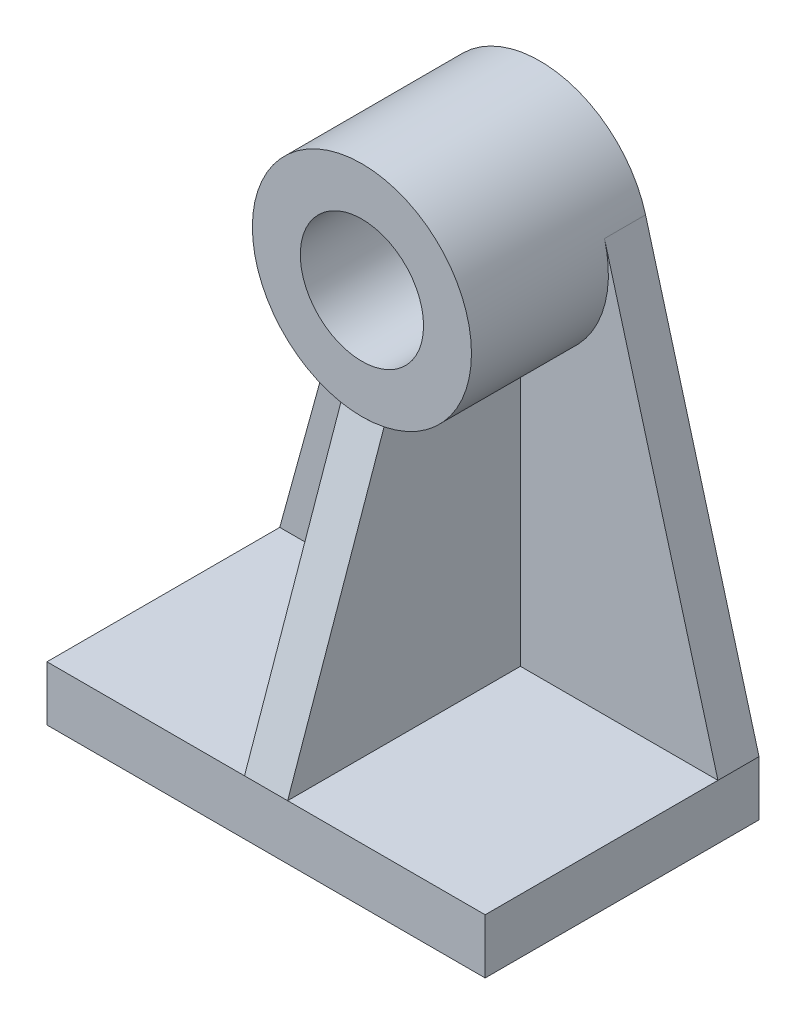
ISO-10303-21;
HEADER;
FILE_DESCRIPTION(('STEP AP214'),'2;1');
FILE_NAME('part.step','',(''),(''),'','','');
FILE_SCHEMA(('AUTOMOTIVE_DESIGN { 1 0 10303 214 1 1 1 1 }'));
ENDSEC;
DATA;
#1=APPLICATION_CONTEXT('core data for automotive mechanical design processes');
#2=APPLICATION_PROTOCOL_DEFINITION('international standard','automotive_design',2000,#1);
#3=PRODUCT_CONTEXT('',#1,'mechanical');
#4=PRODUCT('Part','Part','',(#3));
#5=PRODUCT_RELATED_PRODUCT_CATEGORY('part','',(#4));
#6=PRODUCT_DEFINITION_FORMATION('','',#4);
#7=PRODUCT_DEFINITION_CONTEXT('part definition',#1,'design');
#8=PRODUCT_DEFINITION('design','',#6,#7);
#9=PRODUCT_DEFINITION_SHAPE('','',#8);
#10=(LENGTH_UNIT() NAMED_UNIT(*) SI_UNIT(.MILLI.,.METRE.));
#11=(NAMED_UNIT(*) PLANE_ANGLE_UNIT() SI_UNIT($,.RADIAN.));
#12=(NAMED_UNIT(*) SI_UNIT($,.STERADIAN.) SOLID_ANGLE_UNIT());
#13=UNCERTAINTY_MEASURE_WITH_UNIT(LENGTH_MEASURE(1.E-05),#10,'distance_accuracy_value','');
#14=(GEOMETRIC_REPRESENTATION_CONTEXT(3) GLOBAL_UNCERTAINTY_ASSIGNED_CONTEXT((#13)) GLOBAL_UNIT_ASSIGNED_CONTEXT((#10,
#11,#12)) REPRESENTATION_CONTEXT('',''));
#15=CARTESIAN_POINT('',(0.,0.,0.));
#16=DIRECTION('',(0.,0.,1.));
#17=DIRECTION('',(1.,0.,0.));
#18=AXIS2_PLACEMENT_3D('',#15,#16,#17);
#19=CARTESIAN_POINT('',(0.,0.,9.525));
#20=DIRECTION('',(0.,0.,1.));
#21=DIRECTION('',(1.,0.,0.));
#22=AXIS2_PLACEMENT_3D('',#19,#20,#21);
#23=PLANE('',#22);
#24=DIRECTION('',(-1.,0.,0.));
#25=VECTOR('',#24,1.);
#26=CARTESIAN_POINT('',(-50.8,-88.9,9.525));
#27=LINE('',#26,#25);
#28=CARTESIAN_POINT('',(-5.,-88.9,9.525));
#29=VERTEX_POINT('',#28);
#30=CARTESIAN_POINT('',(-50.8,-88.9,9.525));
#31=VERTEX_POINT('',#30);
#32=EDGE_CURVE('E156',#29,#31,#27,.T.);
#33=ORIENTED_EDGE('',*,*,#32,.F.);
#34=DIRECTION('',(0.,1.,0.));
#35=VECTOR('',#34,1.);
#36=CARTESIAN_POINT('',(-5.,0.,9.525));
#37=LINE('',#36,#35);
#38=CARTESIAN_POINT('',(-5.,-24.9030118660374,9.525));
#39=VERTEX_POINT('',#38);
#40=EDGE_CURVE('E134',#29,#39,#37,.T.);
#41=ORIENTED_EDGE('',*,*,#40,.T.);
#42=CARTESIAN_POINT('',(0.,0.,9.525));
#43=DIRECTION('',(0.,0.,1.));
#44=DIRECTION('',(1.,0.,0.));
#45=AXIS2_PLACEMENT_3D('',#42,#43,#44);
#46=CIRCLE('',#45,25.4);
#47=CARTESIAN_POINT('',(-24.4901906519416,6.73725180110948,9.525));
#48=VERTEX_POINT('',#47);
#49=EDGE_CURVE('E36',#39,#48,#46,.F.);
#50=ORIENTED_EDGE('',*,*,#49,.T.);
#51=DIRECTION('',(-0.265246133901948,-0.964180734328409,0.));
#52=VECTOR('',#51,1.);
#53=CARTESIAN_POINT('',(-50.8,-88.9,9.525));
#54=LINE('',#53,#52);
#55=EDGE_CURVE('E190',#48,#31,#54,.T.);
#56=ORIENTED_EDGE('',*,*,#55,.T.);
#57=EDGE_LOOP('',(#33,#41,#50,#56));
#58=FACE_BOUND('',#57,.T.);
#59=ADVANCED_FACE('F28',(#58),#23,.T.);
#60=CARTESIAN_POINT('',(-50.8,-88.9,63.5));
#61=DIRECTION('',(0.,-1.,0.));
#62=DIRECTION('',(1.,0.,0.));
#63=AXIS2_PLACEMENT_3D('',#60,#61,#62);
#64=PLANE('',#63);
#65=DIRECTION('',(0.,0.,1.));
#66=VECTOR('',#65,1.);
#67=CARTESIAN_POINT('',(-5.,-88.9,63.5));
#68=LINE('',#67,#66);
#69=CARTESIAN_POINT('',(-5.,-88.9,63.5));
#70=VERTEX_POINT('',#69);
#71=EDGE_CURVE('E128',#29,#70,#68,.T.);
#72=ORIENTED_EDGE('',*,*,#71,.F.);
#73=ORIENTED_EDGE('',*,*,#32,.T.);
#74=DIRECTION('',(0.,0.,-1.));
#75=VECTOR('',#74,1.);
#76=CARTESIAN_POINT('',(-50.8,-88.9,63.5));
#77=LINE('',#76,#75);
#78=CARTESIAN_POINT('',(-50.8,-88.9,63.5));
#79=VERTEX_POINT('',#78);
#80=EDGE_CURVE('E171',#79,#31,#77,.T.);
#81=ORIENTED_EDGE('',*,*,#80,.F.);
#82=DIRECTION('',(-1.,0.,0.));
#83=VECTOR('',#82,1.);
#84=CARTESIAN_POINT('',(-50.8,-88.9,63.5));
#85=LINE('',#84,#83);
#86=EDGE_CURVE('E164',#70,#79,#85,.T.);
#87=ORIENTED_EDGE('',*,*,#86,.F.);
#88=EDGE_LOOP('',(#72,#73,#81,#87));
#89=FACE_BOUND('',#88,.T.);
#90=ADVANCED_FACE('F238',(#89),#64,.F.);
#91=DIRECTION('',(0.,1.,0.));
#92=VECTOR('',#91,1.);
#93=CARTESIAN_POINT('',(5.,0.,9.525));
#94=LINE('',#93,#92);
#95=CARTESIAN_POINT('',(5.,-88.9,9.525));
#96=VERTEX_POINT('',#95);
#97=CARTESIAN_POINT('',(5.,-24.9030118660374,9.525));
#98=VERTEX_POINT('',#97);
#99=EDGE_CURVE('E137',#96,#98,#94,.T.);
#100=ORIENTED_EDGE('',*,*,#99,.F.);
#101=CARTESIAN_POINT('',(50.8,-88.9,9.525));
#102=VERTEX_POINT('',#101);
#103=EDGE_CURVE('E157',#102,#96,#27,.T.);
#104=ORIENTED_EDGE('',*,*,#103,.F.);
#105=DIRECTION('',(-0.265246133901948,0.964180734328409,0.));
#106=VECTOR('',#105,1.);
#107=CARTESIAN_POINT('',(50.8,-88.9,9.525));
#108=LINE('',#107,#106);
#109=CARTESIAN_POINT('',(24.4901906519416,6.73725180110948,9.525));
#110=VERTEX_POINT('',#109);
#111=EDGE_CURVE('E192',#102,#110,#108,.T.);
#112=ORIENTED_EDGE('',*,*,#111,.T.);
#113=EDGE_CURVE('E11',#110,#98,#46,.F.);
#114=ORIENTED_EDGE('',*,*,#113,.T.);
#115=EDGE_LOOP('',(#100,#104,#112,#114));
#116=FACE_BOUND('',#115,.T.);
#117=ADVANCED_FACE('F242',(#116),#23,.T.);
#118=CARTESIAN_POINT('',(-50.8,-88.9,9.525));
#119=DIRECTION('',(0.964180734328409,-0.265246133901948,0.));
#120=DIRECTION('',(0.265246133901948,0.964180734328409,0.));
#121=AXIS2_PLACEMENT_3D('',#118,#119,#120);
#122=PLANE('',#121);
#123=DIRECTION('',(-0.265246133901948,-0.964180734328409,0.));
#124=VECTOR('',#123,1.);
#125=CARTESIAN_POINT('',(-50.8,-88.9,0.));
#126=LINE('',#125,#124);
#127=CARTESIAN_POINT('',(-24.4901906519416,6.73725180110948,0.));
#128=VERTEX_POINT('',#127);
#129=CARTESIAN_POINT('',(-50.8,-88.9,0.));
#130=VERTEX_POINT('',#129);
#131=EDGE_CURVE('E177',#128,#130,#126,.T.);
#132=ORIENTED_EDGE('',*,*,#131,.T.);
#133=DIRECTION('',(0.,0.,-1.));
#134=VECTOR('',#133,1.);
#135=CARTESIAN_POINT('',(-50.8,-88.9,9.525));
#136=LINE('',#135,#134);
#137=EDGE_CURVE('E209',#31,#130,#136,.T.);
#138=ORIENTED_EDGE('',*,*,#137,.F.);
#139=ORIENTED_EDGE('',*,*,#55,.F.);
#140=DIRECTION('',(0.,0.,-1.));
#141=VECTOR('',#140,1.);
#142=CARTESIAN_POINT('',(-24.4901906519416,6.73725180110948,9.525));
#143=LINE('',#142,#141);
#144=EDGE_CURVE('E195',#48,#128,#143,.T.);
#145=ORIENTED_EDGE('',*,*,#144,.T.);
#146=EDGE_LOOP('',(#132,#138,#139,#145));
#147=FACE_BOUND('',#146,.T.);
#148=ADVANCED_FACE('F30',(#147),#122,.F.);
#149=CARTESIAN_POINT('',(-50.8,-101.6,9.525));
#150=DIRECTION('',(1.,0.,0.));
#151=DIRECTION('',(0.,1.,0.));
#152=AXIS2_PLACEMENT_3D('',#149,#150,#151);
#153=PLANE('',#152);
#154=DIRECTION('',(0.,-1.,0.));
#155=VECTOR('',#154,1.);
#156=CARTESIAN_POINT('',(-50.8,-101.6,0.));
#157=LINE('',#156,#155);
#158=CARTESIAN_POINT('',(-50.8,-101.6,0.));
#159=VERTEX_POINT('',#158);
#160=EDGE_CURVE('E180',#130,#159,#157,.T.);
#161=ORIENTED_EDGE('',*,*,#160,.T.);
#162=DIRECTION('',(0.,0.,-1.));
#163=VECTOR('',#162,1.);
#164=CARTESIAN_POINT('',(-50.8,-101.6,9.525));
#165=LINE('',#164,#163);
#166=CARTESIAN_POINT('',(-50.8,-101.6,63.5));
#167=VERTEX_POINT('',#166);
#168=EDGE_CURVE('E207',#167,#159,#165,.T.);
#169=ORIENTED_EDGE('',*,*,#168,.F.);
#170=DIRECTION('',(0.,-1.,0.));
#171=VECTOR('',#170,1.);
#172=CARTESIAN_POINT('',(-50.8,-88.9,63.5));
#173=LINE('',#172,#171);
#174=EDGE_CURVE('E168',#79,#167,#173,.T.);
#175=ORIENTED_EDGE('',*,*,#174,.F.);
#176=ORIENTED_EDGE('',*,*,#80,.T.);
#177=ORIENTED_EDGE('',*,*,#137,.T.);
#178=EDGE_LOOP('',(#161,#169,#175,#176,#177));
#179=FACE_BOUND('',#178,.T.);
#180=ADVANCED_FACE('F213',(#179),#153,.F.);
#181=CARTESIAN_POINT('',(-50.8,-101.6,9.525));
#182=DIRECTION('',(0.,1.,0.));
#183=DIRECTION('',(-1.,0.,0.));
#184=AXIS2_PLACEMENT_3D('',#181,#182,#183);
#185=PLANE('',#184);
#186=DIRECTION('',(0.,0.,-1.));
#187=VECTOR('',#186,1.);
#188=CARTESIAN_POINT('',(50.8,-101.6,9.525));
#189=LINE('',#188,#187);
#190=CARTESIAN_POINT('',(50.8,-101.6,63.5));
#191=VERTEX_POINT('',#190);
#192=CARTESIAN_POINT('',(50.8,-101.6,0.));
#193=VERTEX_POINT('',#192);
#194=EDGE_CURVE('E204',#191,#193,#189,.T.);
#195=ORIENTED_EDGE('',*,*,#194,.F.);
#196=DIRECTION('',(1.,0.,0.));
#197=VECTOR('',#196,1.);
#198=CARTESIAN_POINT('',(-50.8,-101.6,63.5));
#199=LINE('',#198,#197);
#200=EDGE_CURVE('E160',#167,#191,#199,.T.);
#201=ORIENTED_EDGE('',*,*,#200,.F.);
#202=ORIENTED_EDGE('',*,*,#168,.T.);
#203=DIRECTION('',(1.,0.,0.));
#204=VECTOR('',#203,1.);
#205=CARTESIAN_POINT('',(-50.8,-101.6,0.));
#206=LINE('',#205,#204);
#207=EDGE_CURVE('E182',#159,#193,#206,.T.);
#208=ORIENTED_EDGE('',*,*,#207,.T.);
#209=EDGE_LOOP('',(#195,#201,#202,#208));
#210=FACE_BOUND('',#209,.T.);
#211=ADVANCED_FACE('F227',(#210),#185,.F.);
#212=CARTESIAN_POINT('',(50.8,-101.6,9.525));
#213=DIRECTION('',(-1.,0.,0.));
#214=DIRECTION('',(0.,0.,1.));
#215=AXIS2_PLACEMENT_3D('',#212,#213,#214);
#216=PLANE('',#215);
#217=DIRECTION('',(0.,1.,0.));
#218=VECTOR('',#217,1.);
#219=CARTESIAN_POINT('',(50.8,-101.6,0.));
#220=LINE('',#219,#218);
#221=CARTESIAN_POINT('',(50.8,-88.9,0.));
#222=VERTEX_POINT('',#221);
#223=EDGE_CURVE('E184',#193,#222,#220,.T.);
#224=ORIENTED_EDGE('',*,*,#223,.T.);
#225=DIRECTION('',(0.,0.,-1.));
#226=VECTOR('',#225,1.);
#227=CARTESIAN_POINT('',(50.8,-88.9,9.525));
#228=LINE('',#227,#226);
#229=EDGE_CURVE('E201',#102,#222,#228,.T.);
#230=ORIENTED_EDGE('',*,*,#229,.F.);
#231=DIRECTION('',(0.,0.,-1.));
#232=VECTOR('',#231,1.);
#233=CARTESIAN_POINT('',(50.8,-88.9,63.5));
#234=LINE('',#233,#232);
#235=CARTESIAN_POINT('',(50.8,-88.9,63.5));
#236=VERTEX_POINT('',#235);
#237=EDGE_CURVE('E174',#236,#102,#234,.T.);
#238=ORIENTED_EDGE('',*,*,#237,.F.);
#239=DIRECTION('',(0.,1.,0.));
#240=VECTOR('',#239,1.);
#241=CARTESIAN_POINT('',(50.8,-101.6,63.5));
#242=LINE('',#241,#240);
#243=EDGE_CURVE('E162',#191,#236,#242,.T.);
#244=ORIENTED_EDGE('',*,*,#243,.F.);
#245=ORIENTED_EDGE('',*,*,#194,.T.);
#246=EDGE_LOOP('',(#224,#230,#238,#244,#245));
#247=FACE_BOUND('',#246,.T.);
#248=ADVANCED_FACE('F231',(#247),#216,.F.);
#249=CARTESIAN_POINT('',(50.8,-88.9,9.525));
#250=DIRECTION('',(-0.964180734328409,-0.265246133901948,0.));
#251=DIRECTION('',(0.265246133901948,-0.964180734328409,0.));
#252=AXIS2_PLACEMENT_3D('',#249,#250,#251);
#253=PLANE('',#252);
#254=DIRECTION('',(-0.265246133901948,0.964180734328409,0.));
#255=VECTOR('',#254,1.);
#256=CARTESIAN_POINT('',(50.8,-88.9,0.));
#257=LINE('',#256,#255);
#258=CARTESIAN_POINT('',(24.4901906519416,6.73725180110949,0.));
#259=VERTEX_POINT('',#258);
#260=EDGE_CURVE('E186',#222,#259,#257,.T.);
#261=ORIENTED_EDGE('',*,*,#260,.T.);
#262=DIRECTION('',(0.,0.,-1.));
#263=VECTOR('',#262,1.);
#264=CARTESIAN_POINT('',(24.4901906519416,6.73725180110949,9.525));
#265=LINE('',#264,#263);
#266=EDGE_CURVE('E198',#110,#259,#265,.T.);
#267=ORIENTED_EDGE('',*,*,#266,.F.);
#268=ORIENTED_EDGE('',*,*,#111,.F.);
#269=ORIENTED_EDGE('',*,*,#229,.T.);
#270=EDGE_LOOP('',(#261,#267,#268,#269));
#271=FACE_BOUND('',#270,.T.);
#272=ADVANCED_FACE('F284',(#271),#253,.F.);
#273=CARTESIAN_POINT('',(0.,0.,9.525));
#274=DIRECTION('',(0.,0.,-1.));
#275=DIRECTION('',(-1.,0.,0.));
#276=AXIS2_PLACEMENT_3D('',#273,#274,#275);
#277=CYLINDRICAL_SURFACE('',#276,25.4);
#278=CARTESIAN_POINT('',(0.,0.,32.385));
#279=DIRECTION('',(0.,-0.330350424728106,-0.943858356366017));
#280=DIRECTION('',(0.,0.943858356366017,-0.330350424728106));
#281=AXIS2_PLACEMENT_3D('',#278,#279,#280);
#282=ELLIPSE('',#281,26.9108175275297,25.4);
#283=CARTESIAN_POINT('',(0.,-25.4,41.275));
#284=VERTEX_POINT('',#283);
#285=CARTESIAN_POINT('',(5.,-24.9030118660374,41.1010541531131));
#286=VERTEX_POINT('',#285);
#287=EDGE_CURVE('E117',#284,#286,#282,.F.);
#288=ORIENTED_EDGE('',*,*,#287,.T.);
#289=DIRECTION('',(0.,0.,-1.));
#290=VECTOR('',#289,1.);
#291=CARTESIAN_POINT('',(5.,-24.9030118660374,9.525));
#292=LINE('',#291,#290);
#293=EDGE_CURVE('E143',#286,#98,#292,.T.);
#294=ORIENTED_EDGE('',*,*,#293,.T.);
#295=ORIENTED_EDGE('',*,*,#113,.F.);
#296=ORIENTED_EDGE('',*,*,#266,.T.);
#297=CARTESIAN_POINT('',(0.,0.,0.));
#298=DIRECTION('',(0.,0.,1.));
#299=DIRECTION('',(1.,0.,0.));
#300=AXIS2_PLACEMENT_3D('',#297,#298,#299);
#301=CIRCLE('',#300,25.4);
#302=EDGE_CURVE('E188',#259,#128,#301,.T.);
#303=ORIENTED_EDGE('',*,*,#302,.T.);
#304=ORIENTED_EDGE('',*,*,#144,.F.);
#305=ORIENTED_EDGE('',*,*,#49,.F.);
#306=DIRECTION('',(0.,0.,-1.));
#307=VECTOR('',#306,1.);
#308=CARTESIAN_POINT('',(-5.,-24.9030118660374,9.525));
#309=LINE('',#308,#307);
#310=CARTESIAN_POINT('',(-5.,-24.9030118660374,41.1010541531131));
#311=VERTEX_POINT('',#310);
#312=EDGE_CURVE('E126',#311,#39,#309,.T.);
#313=ORIENTED_EDGE('',*,*,#312,.F.);
#314=EDGE_CURVE('E113',#311,#284,#282,.F.);
#315=ORIENTED_EDGE('',*,*,#314,.T.);
#316=CARTESIAN_POINT('',(0.,0.,41.275));
#317=DIRECTION('',(0.,0.,1.));
#318=DIRECTION('',(1.,0.,0.));
#319=AXIS2_PLACEMENT_3D('',#316,#317,#318);
#320=CIRCLE('',#319,25.4);
#321=EDGE_CURVE('E154',#284,#284,#320,.T.);
#322=ORIENTED_EDGE('',*,*,#321,.F.);
#323=EDGE_LOOP('',(#288,#294,#295,#296,#303,#304,#305,#313,#315,#322));
#324=FACE_BOUND('',#323,.T.);
#325=ADVANCED_FACE('F132',(#324),#277,.T.);
#326=CARTESIAN_POINT('',(0.,0.,0.));
#327=DIRECTION('',(0.,0.,1.));
#328=DIRECTION('',(1.,0.,0.));
#329=AXIS2_PLACEMENT_3D('',#326,#327,#328);
#330=PLANE('',#329);
#331=CARTESIAN_POINT('',(0.,0.,0.));
#332=DIRECTION('',(0.,0.,1.));
#333=DIRECTION('',(1.,0.,0.));
#334=AXIS2_PLACEMENT_3D('',#331,#332,#333);
#335=CIRCLE('',#334,14.2875);
#336=CARTESIAN_POINT('',(14.2875,0.,0.));
#337=VERTEX_POINT('',#336);
#338=EDGE_CURVE('E151',#337,#337,#335,.T.);
#339=ORIENTED_EDGE('',*,*,#338,.T.);
#340=EDGE_LOOP('',(#339));
#341=FACE_BOUND('',#340,.T.);
#342=ORIENTED_EDGE('',*,*,#223,.F.);
#343=ORIENTED_EDGE('',*,*,#207,.F.);
#344=ORIENTED_EDGE('',*,*,#160,.F.);
#345=ORIENTED_EDGE('',*,*,#131,.F.);
#346=ORIENTED_EDGE('',*,*,#302,.F.);
#347=ORIENTED_EDGE('',*,*,#260,.F.);
#348=EDGE_LOOP('',(#342,#343,#344,#345,#346,#347));
#349=FACE_BOUND('',#348,.T.);
#350=ADVANCED_FACE('F222',(#341,#349),#330,.F.);
#351=ORIENTED_EDGE('',*,*,#103,.T.);
#352=DIRECTION('',(0.,0.,1.));
#353=VECTOR('',#352,1.);
#354=CARTESIAN_POINT('',(5.,-88.9,63.5));
#355=LINE('',#354,#353);
#356=CARTESIAN_POINT('',(5.,-88.9,63.5));
#357=VERTEX_POINT('',#356);
#358=EDGE_CURVE('E133',#96,#357,#355,.T.);
#359=ORIENTED_EDGE('',*,*,#358,.T.);
#360=EDGE_CURVE('E165',#236,#357,#85,.T.);
#361=ORIENTED_EDGE('',*,*,#360,.F.);
#362=ORIENTED_EDGE('',*,*,#237,.T.);
#363=EDGE_LOOP('',(#351,#359,#361,#362));
#364=FACE_BOUND('',#363,.T.);
#365=ADVANCED_FACE('F248',(#364),#64,.F.);
#366=CARTESIAN_POINT('',(50.8,-101.6,63.5));
#367=DIRECTION('',(0.,0.,1.));
#368=DIRECTION('',(1.,0.,0.));
#369=AXIS2_PLACEMENT_3D('',#366,#367,#368);
#370=PLANE('',#369);
#371=ORIENTED_EDGE('',*,*,#360,.T.);
#372=DIRECTION('',(1.,0.,0.));
#373=VECTOR('',#372,1.);
#374=CARTESIAN_POINT('',(50.8,-88.9,63.5));
#375=LINE('',#374,#373);
#376=EDGE_CURVE('E146',#357,#70,#375,.F.);
#377=ORIENTED_EDGE('',*,*,#376,.T.);
#378=ORIENTED_EDGE('',*,*,#86,.T.);
#379=ORIENTED_EDGE('',*,*,#174,.T.);
#380=ORIENTED_EDGE('',*,*,#200,.T.);
#381=ORIENTED_EDGE('',*,*,#243,.T.);
#382=EDGE_LOOP('',(#371,#377,#378,#379,#380,#381));
#383=FACE_BOUND('',#382,.T.);
#384=ADVANCED_FACE('F236',(#383),#370,.T.);
#385=CARTESIAN_POINT('',(0.,0.,41.275));
#386=DIRECTION('',(0.,0.,1.));
#387=DIRECTION('',(1.,0.,0.));
#388=AXIS2_PLACEMENT_3D('',#385,#386,#387);
#389=PLANE('',#388);
#390=CARTESIAN_POINT('',(0.,0.,41.275));
#391=DIRECTION('',(0.,0.,1.));
#392=DIRECTION('',(1.,0.,0.));
#393=AXIS2_PLACEMENT_3D('',#390,#391,#392);
#394=CIRCLE('',#393,14.2875);
#395=CARTESIAN_POINT('',(14.2875,0.,41.275));
#396=VERTEX_POINT('',#395);
#397=EDGE_CURVE('E122',#396,#396,#394,.T.);
#398=ORIENTED_EDGE('',*,*,#397,.F.);
#399=EDGE_LOOP('',(#398));
#400=FACE_BOUND('',#399,.T.);
#401=ORIENTED_EDGE('',*,*,#321,.T.);
#402=EDGE_LOOP('',(#401));
#403=FACE_BOUND('',#402,.T.);
#404=ADVANCED_FACE('F264',(#400,#403),#389,.T.);
#405=CARTESIAN_POINT('',(0.,0.,0.));
#406=DIRECTION('',(0.,0.,1.));
#407=DIRECTION('',(1.,0.,0.));
#408=AXIS2_PLACEMENT_3D('',#405,#406,#407);
#409=CYLINDRICAL_SURFACE('',#408,14.2875);
#410=ORIENTED_EDGE('',*,*,#338,.F.);
#411=EDGE_LOOP('',(#410));
#412=FACE_BOUND('',#411,.T.);
#413=ORIENTED_EDGE('',*,*,#397,.T.);
#414=EDGE_LOOP('',(#413));
#415=FACE_BOUND('',#414,.T.);
#416=ADVANCED_FACE('F266',(#412,#415),#409,.F.);
#417=CARTESIAN_POINT('',(0.,-88.9,63.5));
#418=DIRECTION('',(0.,-0.330350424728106,-0.943858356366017));
#419=DIRECTION('',(0.,0.943858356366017,-0.330350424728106));
#420=AXIS2_PLACEMENT_3D('',#417,#418,#419);
#421=PLANE('',#420);
#422=ORIENTED_EDGE('',*,*,#314,.F.);
#423=DIRECTION('',(0.,0.943858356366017,-0.330350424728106));
#424=VECTOR('',#423,1.);
#425=CARTESIAN_POINT('',(-5.,-88.9,63.5));
#426=LINE('',#425,#424);
#427=EDGE_CURVE('E43',#70,#311,#426,.T.);
#428=ORIENTED_EDGE('',*,*,#427,.F.);
#429=ORIENTED_EDGE('',*,*,#376,.F.);
#430=DIRECTION('',(0.,0.943858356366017,-0.330350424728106));
#431=VECTOR('',#430,1.);
#432=CARTESIAN_POINT('',(5.,-88.9,63.5));
#433=LINE('',#432,#431);
#434=EDGE_CURVE('E130',#357,#286,#433,.T.);
#435=ORIENTED_EDGE('',*,*,#434,.T.);
#436=ORIENTED_EDGE('',*,*,#287,.F.);
#437=EDGE_LOOP('',(#422,#428,#429,#435,#436));
#438=FACE_BOUND('',#437,.T.);
#439=ADVANCED_FACE('F114',(#438),#421,.F.);
#440=CARTESIAN_POINT('',(5.,-38.1,31.75));
#441=DIRECTION('',(1.,0.,0.));
#442=DIRECTION('',(0.,0.,-1.));
#443=AXIS2_PLACEMENT_3D('',#440,#441,#442);
#444=PLANE('',#443);
#445=ORIENTED_EDGE('',*,*,#293,.F.);
#446=ORIENTED_EDGE('',*,*,#434,.F.);
#447=ORIENTED_EDGE('',*,*,#358,.F.);
#448=ORIENTED_EDGE('',*,*,#99,.T.);
#449=EDGE_LOOP('',(#445,#446,#447,#448));
#450=FACE_BOUND('',#449,.T.);
#451=ADVANCED_FACE('F261',(#450),#444,.T.);
#452=CARTESIAN_POINT('',(-5.,-38.1,31.75));
#453=DIRECTION('',(1.,0.,0.));
#454=DIRECTION('',(0.,0.,-1.));
#455=AXIS2_PLACEMENT_3D('',#452,#453,#454);
#456=PLANE('',#455);
#457=ORIENTED_EDGE('',*,*,#427,.T.);
#458=ORIENTED_EDGE('',*,*,#312,.T.);
#459=ORIENTED_EDGE('',*,*,#40,.F.);
#460=ORIENTED_EDGE('',*,*,#71,.T.);
#461=EDGE_LOOP('',(#457,#458,#459,#460));
#462=FACE_BOUND('',#461,.T.);
#463=ADVANCED_FACE('F125',(#462),#456,.F.);
#464=CLOSED_SHELL('',(#59,#90,#117,#148,#180,#211,#248,#272,#325,#350,#365,#384,#404,#416,#439,
#451,#463));
#465=MANIFOLD_SOLID_BREP('B2',#464);
#466=ADVANCED_BREP_SHAPE_REPRESENTATION('',(#18,#465),#14);
#467=SHAPE_DEFINITION_REPRESENTATION(#9,#466);
ENDSEC;
END-ISO-10303-21;
